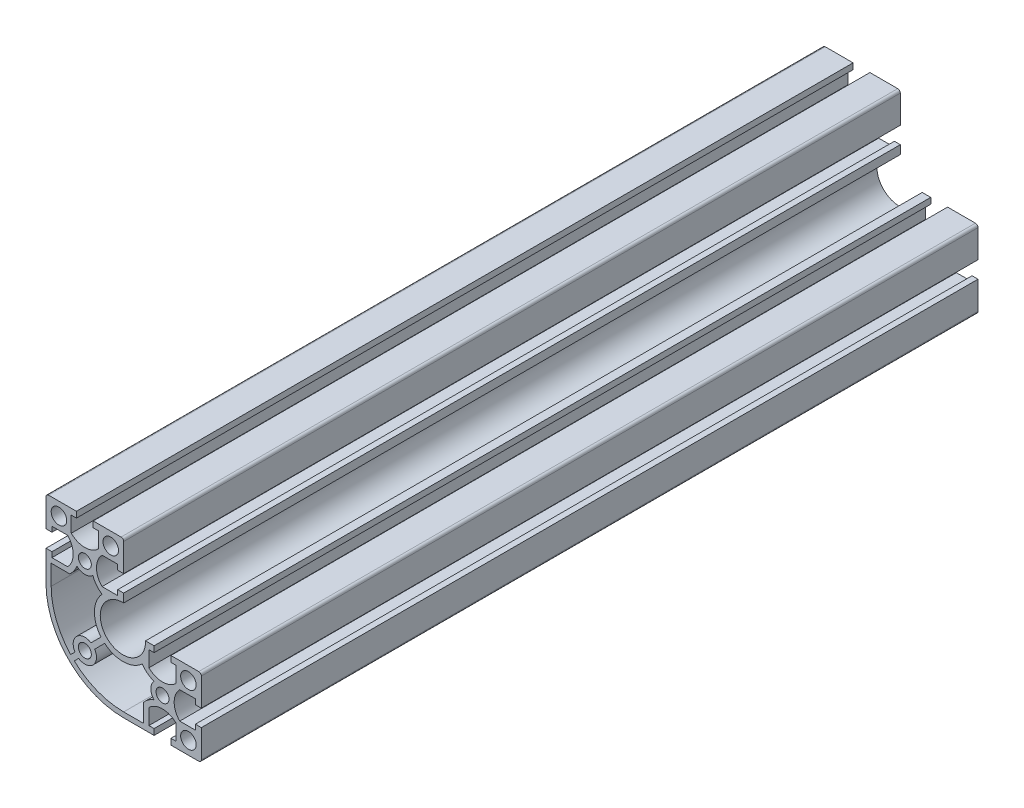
from build123d import *

# Parameters (mm, degrees)
SKETCH_1_R      = 3
SKETCH_1_R_2    = 2.5
EXTRUDE_1_DEPTH = 150


with BuildPart() as part:
    # Sketch 1 → Extrude 1 (new, symmetric)
    with BuildSketch(Plane.XY):
        with BuildLine():
            Line((12.05, -2), (10.05, -2))
            Line((10.05, -2), (10.05, -8.056071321))
            ThreePointArc((10.05, -8.056071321), (15.3, -10.2), (20.55, -8.056071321))
            Line((20.55, -8.056071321), (20.55, -2))
            Line((20.55, -2), (18.55, -2))
            Line((18.55, -2), (18.55, 0.3))
            Line((18.55, 0.3), (29.3, 0.3))
            ThreePointArc((29.3, 0.3), (30.007106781, 0.007106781), (30.3, -0.7))
            Line((30.3, -0.7), (30.3, -11.45))
            Line((30.3, -11.45), (28, -11.45))
            Line((28, -11.45), (28, -9.45))
            Line((28, -9.45), (21.943928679, -9.45))
            ThreePointArc((21.943928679, -9.45), (19.8, -14.7), (21.943928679, -19.95))
            Line((21.943928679, -19.95), (28, -19.95))
            Line((28, -19.95), (28, -17.95))
            Line((28, -17.95), (30.3, -17.95))
            Line((30.3, -17.95), (30.3, -28.7))
            ThreePointArc((30.3, -28.7), (30.007106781, -29.407106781), (29.3, -29.7))
            Line((29.3, -29.7), (18.55, -29.7))
            Line((18.55, -29.7), (18.55, -27.4))
            Line((18.55, -27.4), (20.55, -27.4))
            Line((20.55, -27.4), (20.55, -21.343928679))
            ThreePointArc((20.55, -21.343928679), (15.3, -19.2), (10.05, -21.343928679))
            Line((10.05, -21.343928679), (10.05, -27.4))
            Line((10.05, -27.4), (12.05, -27.4))
            Line((12.05, -27.4), (12.05, -29.7))
            Line((12.05, -29.7), (0.3, -29.7))
            ThreePointArc((0.3, -29.7), (-20.913203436, -20.913203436), (-29.7, 0.3))
            Line((-29.7, 0.3), (-29.7, 12.05))
            Line((-29.7, 12.05), (-27.4, 12.05))
            Line((-27.4, 12.05), (-27.4, 10.05))
            Line((-27.4, 10.05), (-21.343928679, 10.05))
            ThreePointArc((-21.343928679, 10.05), (-19.2, 15.3), (-21.343928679, 20.55))
            Line((-21.343928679, 20.55), (-27.4, 20.55))
            Line((-27.4, 20.55), (-27.4, 18.55))
            Line((-27.4, 18.55), (-29.7, 18.55))
            Line((-29.7, 18.55), (-29.7, 29.3))
            ThreePointArc((-29.7, 29.3), (-29.407106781, 30.007106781), (-28.7, 30.3))
            Line((-28.7, 30.3), (-17.95, 30.3))
            Line((-17.95, 30.3), (-17.95, 28))
            Line((-17.95, 28), (-19.95, 28))
            Line((-19.95, 28), (-19.95, 21.943928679))
            ThreePointArc((-19.95, 21.943928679), (-14.7, 19.8), (-9.45, 21.943928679))
            Line((-9.45, 21.943928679), (-9.45, 28))
            Line((-9.45, 28), (-11.45, 28))
            Line((-11.45, 28), (-11.45, 30.3))
            Line((-11.45, 30.3), (-0.7, 30.3))
            ThreePointArc((-0.7, 30.3), (0.007106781, 30.007106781), (0.3, 29.3))
            Line((0.3, 29.3), (0.3, 18.55))
            Line((0.3, 18.55), (-2, 18.55))
            Line((-2, 18.55), (-2, 20.55))
            Line((-2, 20.55), (-8.056071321, 20.55))
            ThreePointArc((-8.056071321, 20.55), (-10.2, 15.3), (-8.056071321, 10.05))
            Line((-8.056071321, 10.05), (-2, 10.05))
            Line((-2, 10.05), (-2, 12.05))
            Line((-2, 12.05), (0.3, 12.05))
            Line((0.3, 12.05), (0.3, 8.744855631))
            ThreePointArc((0.3, 8.744855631), (-6.187184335, -6.187184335), (8.744855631, 0.3))
            Line((8.744855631, 0.3), (12.05, 0.3))
            Line((12.05, 0.3), (12.05, -2))
        make_face()
        with Locations((-4.7, 25.3)):
            Circle(SKETCH_1_R, mode=Mode.SUBTRACT)
        with Locations((-24.7, 25.3)):
            Circle(SKETCH_1_R, mode=Mode.SUBTRACT)
        with Locations((-14.7, 15.3)):
            Circle(SKETCH_1_R_2, mode=Mode.SUBTRACT)
        with Locations((-14.7, -14.7)):
            Circle(SKETCH_1_R_2, mode=Mode.SUBTRACT)
        with Locations((15.3, -14.7)):
            Circle(SKETCH_1_R_2, mode=Mode.SUBTRACT)
        with Locations((25.3, -24.7)):
            Circle(SKETCH_1_R, mode=Mode.SUBTRACT)
        with Locations((25.3, -4.7)):
            Circle(SKETCH_1_R, mode=Mode.SUBTRACT)
        with BuildLine():
            Line((-18.509525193, -17.09531163), (-20.193465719, -18.779252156))
            ThreePointArc((-20.193465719, -18.779252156), (-25.755873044, -9.951413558), (-27.7, 0.3))
            Line((-27.7, 0.3), (-27.7, 8.05))
            Line((-27.7, 8.05), (-20.560985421, 8.05))
            ThreePointArc((-20.560985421, 8.05), (-18.914548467, 9.856035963), (-17.783333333, 12.022339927))
            ThreePointArc((-17.783333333, 12.022339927), (-14.7, 10.8), (-11.616666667, 12.022339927))
            ThreePointArc((-11.616666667, 12.022339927), (-10.200667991, 9.469907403), (-8.076576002, 7.467859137))
            ThreePointArc((-8.076576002, 7.467859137), (-10.99629721, 0.285390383), (-8.453073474, -7.038859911))
            Line((-8.453073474, -7.038859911), (-12.30468837, -10.890474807))
            ThreePointArc((-12.30468837, -10.890474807), (-17.881980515, -11.518019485), (-18.509525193, -17.09531163))
        make_face(mode=Mode.SUBTRACT)
        with BuildLine():
            Line((8.05, -20.560985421), (8.05, -27.7))
            Line((8.05, -27.7), (0.3, -27.7))
            ThreePointArc((0.3, -27.7), (-9.951413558, -25.755873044), (-18.779252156, -20.193465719))
            Line((-18.779252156, -20.193465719), (-17.09531163, -18.509525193))
            ThreePointArc((-17.09531163, -18.509525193), (-11.518019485, -17.881980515), (-10.890474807, -12.30468837))
            Line((-10.890474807, -12.30468837), (-7.038859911, -8.453073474))
            ThreePointArc((-7.038859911, -8.453073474), (0.285390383, -10.99629721), (7.467859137, -8.076576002))
            ThreePointArc((7.467859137, -8.076576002), (9.469907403, -10.200667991), (12.022339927, -11.616666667))
            ThreePointArc((12.022339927, -11.616666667), (10.8, -14.7), (12.022339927, -17.783333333))
            ThreePointArc((12.022339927, -17.783333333), (9.856035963, -18.914548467), (8.05, -20.560985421))
        make_face(mode=Mode.SUBTRACT)
    extrude(amount=EXTRUDE_1_DEPTH, both=True)


solid = part.part
